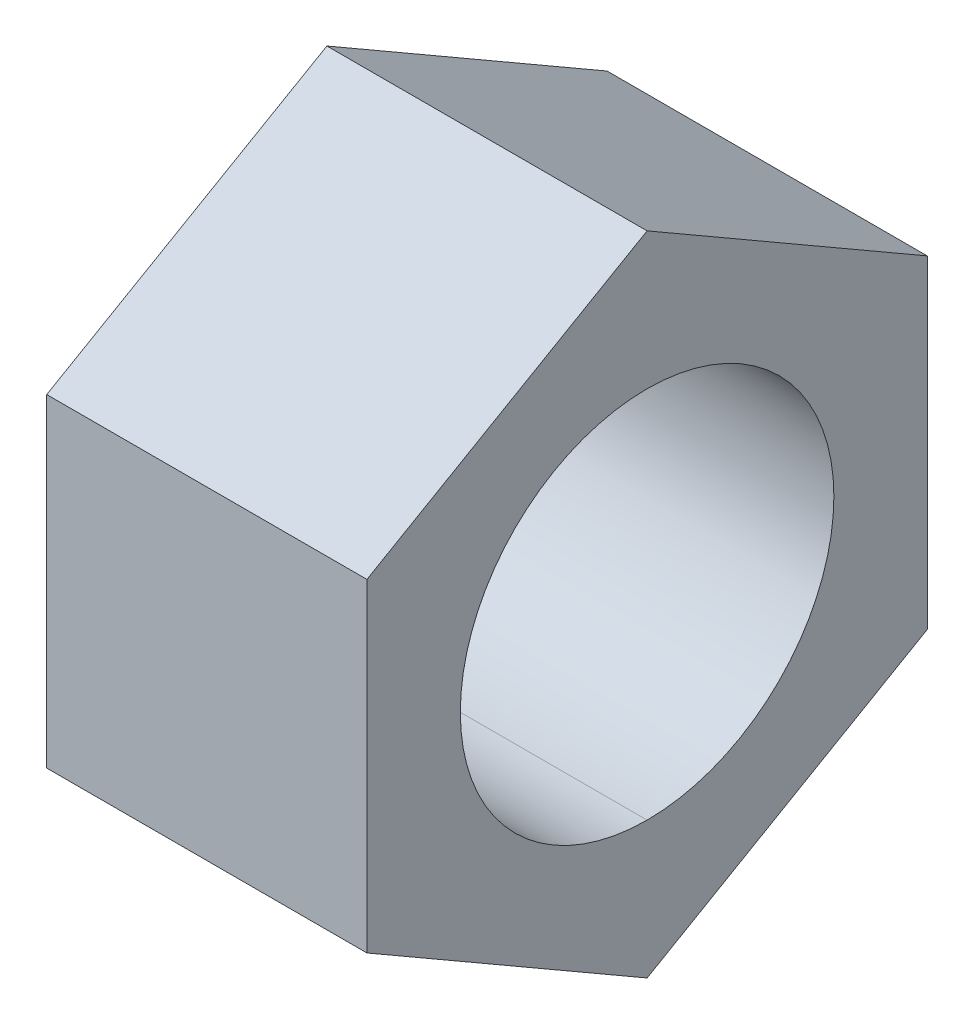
ISO-10303-21;
HEADER;
FILE_DESCRIPTION(('STEP AP214'),'2;1');
FILE_NAME('part.step','',(''),(''),'','','');
FILE_SCHEMA(('AUTOMOTIVE_DESIGN { 1 0 10303 214 1 1 1 1 }'));
ENDSEC;
DATA;
#1=APPLICATION_CONTEXT('core data for automotive mechanical design processes');
#2=APPLICATION_PROTOCOL_DEFINITION('international standard','automotive_design',2000,#1);
#3=PRODUCT_CONTEXT('',#1,'mechanical');
#4=PRODUCT('Part','Part','',(#3));
#5=PRODUCT_RELATED_PRODUCT_CATEGORY('part','',(#4));
#6=PRODUCT_DEFINITION_FORMATION('','',#4);
#7=PRODUCT_DEFINITION_CONTEXT('part definition',#1,'design');
#8=PRODUCT_DEFINITION('design','',#6,#7);
#9=PRODUCT_DEFINITION_SHAPE('','',#8);
#10=(LENGTH_UNIT() NAMED_UNIT(*) SI_UNIT(.MILLI.,.METRE.));
#11=(NAMED_UNIT(*) PLANE_ANGLE_UNIT() SI_UNIT($,.RADIAN.));
#12=(NAMED_UNIT(*) SI_UNIT($,.STERADIAN.) SOLID_ANGLE_UNIT());
#13=UNCERTAINTY_MEASURE_WITH_UNIT(LENGTH_MEASURE(1.E-05),#10,'distance_accuracy_value','');
#14=(GEOMETRIC_REPRESENTATION_CONTEXT(3) GLOBAL_UNCERTAINTY_ASSIGNED_CONTEXT((#13)) GLOBAL_UNIT_ASSIGNED_CONTEXT((#10,
#11,#12)) REPRESENTATION_CONTEXT('',''));
#15=CARTESIAN_POINT('',(0.,0.,0.));
#16=DIRECTION('',(0.,0.,1.));
#17=DIRECTION('',(1.,0.,0.));
#18=AXIS2_PLACEMENT_3D('',#15,#16,#17);
#19=CARTESIAN_POINT('',(-9.525,-19.2474145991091,0.));
#20=DIRECTION('',(0.,-0.866025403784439,0.499999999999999));
#21=DIRECTION('',(0.,-0.499999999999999,-0.866025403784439));
#22=AXIS2_PLACEMENT_3D('',#19,#20,#21);
#23=PLANE('',#22);
#24=DIRECTION('',(0.,0.499999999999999,0.866025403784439));
#25=VECTOR('',#24,1.);
#26=CARTESIAN_POINT('',(-9.525,-19.2474145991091,0.));
#27=LINE('',#26,#25);
#28=CARTESIAN_POINT('',(-9.525,-19.2474145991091,0.));
#29=VERTEX_POINT('',#28);
#30=CARTESIAN_POINT('',(-9.525,-9.62370729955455,16.66875));
#31=VERTEX_POINT('',#30);
#32=EDGE_CURVE('E109',#29,#31,#27,.T.);
#33=ORIENTED_EDGE('',*,*,#32,.F.);
#34=DIRECTION('',(1.,0.,0.));
#35=VECTOR('',#34,1.);
#36=CARTESIAN_POINT('',(-9.525,-19.2474145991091,0.));
#37=LINE('',#36,#35);
#38=CARTESIAN_POINT('',(9.525,-19.2474145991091,0.));
#39=VERTEX_POINT('',#38);
#40=EDGE_CURVE('E98',#39,#29,#37,.F.);
#41=ORIENTED_EDGE('',*,*,#40,.F.);
#42=DIRECTION('',(0.,0.499999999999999,0.866025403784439));
#43=VECTOR('',#42,1.);
#44=CARTESIAN_POINT('',(9.525,-19.2474145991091,0.));
#45=LINE('',#44,#43);
#46=CARTESIAN_POINT('',(9.525,-9.62370729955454,16.66875));
#47=VERTEX_POINT('',#46);
#48=EDGE_CURVE('E117',#39,#47,#45,.T.);
#49=ORIENTED_EDGE('',*,*,#48,.T.);
#50=DIRECTION('',(1.,0.,0.));
#51=VECTOR('',#50,1.);
#52=CARTESIAN_POINT('',(-9.525,-9.62370729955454,16.66875));
#53=LINE('',#52,#51);
#54=EDGE_CURVE('E135',#31,#47,#53,.T.);
#55=ORIENTED_EDGE('',*,*,#54,.F.);
#56=EDGE_LOOP('',(#33,#41,#49,#55));
#57=FACE_BOUND('',#56,.T.);
#58=ADVANCED_FACE('F16',(#57),#23,.T.);
#59=CARTESIAN_POINT('',(-9.525,-9.62370729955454,16.66875));
#60=DIRECTION('',(0.,0.,1.));
#61=DIRECTION('',(1.,0.,0.));
#62=AXIS2_PLACEMENT_3D('',#59,#60,#61);
#63=PLANE('',#62);
#64=DIRECTION('',(0.,-1.,0.));
#65=VECTOR('',#64,1.);
#66=CARTESIAN_POINT('',(-9.525,0.,16.66875));
#67=LINE('',#66,#65);
#68=CARTESIAN_POINT('',(-9.525,9.62370729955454,16.66875));
#69=VERTEX_POINT('',#68);
#70=EDGE_CURVE('E107',#31,#69,#67,.F.);
#71=ORIENTED_EDGE('',*,*,#70,.F.);
#72=ORIENTED_EDGE('',*,*,#54,.T.);
#73=DIRECTION('',(0.,-1.,0.));
#74=VECTOR('',#73,1.);
#75=CARTESIAN_POINT('',(9.525,-9.62370729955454,16.66875));
#76=LINE('',#75,#74);
#77=CARTESIAN_POINT('',(9.525,9.62370729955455,16.66875));
#78=VERTEX_POINT('',#77);
#79=EDGE_CURVE('E111',#47,#78,#76,.F.);
#80=ORIENTED_EDGE('',*,*,#79,.T.);
#81=DIRECTION('',(1.,0.,0.));
#82=VECTOR('',#81,1.);
#83=CARTESIAN_POINT('',(-9.525,9.62370729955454,16.66875));
#84=LINE('',#83,#82);
#85=EDGE_CURVE('E133',#69,#78,#84,.T.);
#86=ORIENTED_EDGE('',*,*,#85,.F.);
#87=EDGE_LOOP('',(#71,#72,#80,#86));
#88=FACE_BOUND('',#87,.T.);
#89=ADVANCED_FACE('F205',(#88),#63,.T.);
#90=CARTESIAN_POINT('',(-9.525,9.62370729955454,16.66875));
#91=DIRECTION('',(0.,0.866025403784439,0.499999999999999));
#92=DIRECTION('',(0.,-0.499999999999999,0.866025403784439));
#93=AXIS2_PLACEMENT_3D('',#90,#91,#92);
#94=PLANE('',#93);
#95=DIRECTION('',(0.,0.499999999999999,-0.866025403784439));
#96=VECTOR('',#95,1.);
#97=CARTESIAN_POINT('',(-9.525,9.62370729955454,16.66875));
#98=LINE('',#97,#96);
#99=CARTESIAN_POINT('',(-9.525,19.2474145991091,0.));
#100=VERTEX_POINT('',#99);
#101=EDGE_CURVE('E105',#69,#100,#98,.T.);
#102=ORIENTED_EDGE('',*,*,#101,.F.);
#103=ORIENTED_EDGE('',*,*,#85,.T.);
#104=DIRECTION('',(0.,0.499999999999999,-0.866025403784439));
#105=VECTOR('',#104,1.);
#106=CARTESIAN_POINT('',(9.525,9.62370729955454,16.66875));
#107=LINE('',#106,#105);
#108=CARTESIAN_POINT('',(9.525,19.2474145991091,0.));
#109=VERTEX_POINT('',#108);
#110=EDGE_CURVE('E97',#78,#109,#107,.T.);
#111=ORIENTED_EDGE('',*,*,#110,.T.);
#112=DIRECTION('',(1.,0.,0.));
#113=VECTOR('',#112,1.);
#114=CARTESIAN_POINT('',(-9.525,19.2474145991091,0.));
#115=LINE('',#114,#113);
#116=EDGE_CURVE('E131',#100,#109,#115,.T.);
#117=ORIENTED_EDGE('',*,*,#116,.F.);
#118=EDGE_LOOP('',(#102,#103,#111,#117));
#119=FACE_BOUND('',#118,.T.);
#120=ADVANCED_FACE('F197',(#119),#94,.T.);
#121=CARTESIAN_POINT('',(-9.525,19.2474145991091,0.));
#122=DIRECTION('',(0.,0.866025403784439,-0.499999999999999));
#123=DIRECTION('',(0.,0.499999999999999,0.866025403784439));
#124=AXIS2_PLACEMENT_3D('',#121,#122,#123);
#125=PLANE('',#124);
#126=DIRECTION('',(0.,-0.499999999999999,-0.866025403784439));
#127=VECTOR('',#126,1.);
#128=CARTESIAN_POINT('',(-9.525,19.2474145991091,0.));
#129=LINE('',#128,#127);
#130=CARTESIAN_POINT('',(-9.525,9.62370729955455,-16.66875));
#131=VERTEX_POINT('',#130);
#132=EDGE_CURVE('E85',#100,#131,#129,.T.);
#133=ORIENTED_EDGE('',*,*,#132,.F.);
#134=ORIENTED_EDGE('',*,*,#116,.T.);
#135=DIRECTION('',(0.,-0.499999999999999,-0.866025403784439));
#136=VECTOR('',#135,1.);
#137=CARTESIAN_POINT('',(9.52499999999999,19.2474145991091,0.));
#138=LINE('',#137,#136);
#139=CARTESIAN_POINT('',(9.525,9.62370729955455,-16.66875));
#140=VERTEX_POINT('',#139);
#141=EDGE_CURVE('E123',#109,#140,#138,.T.);
#142=ORIENTED_EDGE('',*,*,#141,.T.);
#143=DIRECTION('',(-1.,0.,0.));
#144=VECTOR('',#143,1.);
#145=CARTESIAN_POINT('',(-9.525,9.62370729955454,-16.66875));
#146=LINE('',#145,#144);
#147=EDGE_CURVE('E129',#131,#140,#146,.F.);
#148=ORIENTED_EDGE('',*,*,#147,.F.);
#149=EDGE_LOOP('',(#133,#134,#142,#148));
#150=FACE_BOUND('',#149,.T.);
#151=ADVANCED_FACE('F190',(#150),#125,.T.);
#152=CARTESIAN_POINT('',(-9.525,9.62370729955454,-16.66875));
#153=DIRECTION('',(0.,0.,-1.));
#154=DIRECTION('',(-1.,0.,0.));
#155=AXIS2_PLACEMENT_3D('',#152,#153,#154);
#156=PLANE('',#155);
#157=DIRECTION('',(0.,-1.,0.));
#158=VECTOR('',#157,1.);
#159=CARTESIAN_POINT('',(-9.525,0.,-16.66875));
#160=LINE('',#159,#158);
#161=CARTESIAN_POINT('',(-9.525,-9.62370729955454,-16.66875));
#162=VERTEX_POINT('',#161);
#163=EDGE_CURVE('E77',#131,#162,#160,.T.);
#164=ORIENTED_EDGE('',*,*,#163,.F.);
#165=ORIENTED_EDGE('',*,*,#147,.T.);
#166=DIRECTION('',(0.,-1.,0.));
#167=VECTOR('',#166,1.);
#168=CARTESIAN_POINT('',(9.525,-9.62370729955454,-16.66875));
#169=LINE('',#168,#167);
#170=CARTESIAN_POINT('',(9.525,-9.62370729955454,-16.66875));
#171=VERTEX_POINT('',#170);
#172=EDGE_CURVE('E93',#140,#171,#169,.T.);
#173=ORIENTED_EDGE('',*,*,#172,.T.);
#174=DIRECTION('',(1.,0.,0.));
#175=VECTOR('',#174,1.);
#176=CARTESIAN_POINT('',(-9.525,-9.62370729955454,-16.66875));
#177=LINE('',#176,#175);
#178=EDGE_CURVE('E90',#162,#171,#177,.T.);
#179=ORIENTED_EDGE('',*,*,#178,.F.);
#180=EDGE_LOOP('',(#164,#165,#173,#179));
#181=FACE_BOUND('',#180,.T.);
#182=ADVANCED_FACE('F91',(#181),#156,.T.);
#183=CARTESIAN_POINT('',(-9.525,-9.62370729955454,-16.66875));
#184=DIRECTION('',(0.,-0.866025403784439,-0.499999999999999));
#185=DIRECTION('',(0.,0.499999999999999,-0.866025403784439));
#186=AXIS2_PLACEMENT_3D('',#183,#184,#185);
#187=PLANE('',#186);
#188=DIRECTION('',(0.,-0.499999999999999,0.866025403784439));
#189=VECTOR('',#188,1.);
#190=CARTESIAN_POINT('',(-9.525,-9.62370729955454,-16.66875));
#191=LINE('',#190,#189);
#192=EDGE_CURVE('E82',#162,#29,#191,.T.);
#193=ORIENTED_EDGE('',*,*,#192,.F.);
#194=ORIENTED_EDGE('',*,*,#178,.T.);
#195=DIRECTION('',(0.,-0.499999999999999,0.866025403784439));
#196=VECTOR('',#195,1.);
#197=CARTESIAN_POINT('',(9.525,-9.62370729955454,-16.66875));
#198=LINE('',#197,#196);
#199=EDGE_CURVE('E120',#171,#39,#198,.T.);
#200=ORIENTED_EDGE('',*,*,#199,.T.);
#201=ORIENTED_EDGE('',*,*,#40,.T.);
#202=EDGE_LOOP('',(#193,#194,#200,#201));
#203=FACE_BOUND('',#202,.T.);
#204=ADVANCED_FACE('F100',(#203),#187,.T.);
#205=CARTESIAN_POINT('',(9.525,-9.62370729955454,16.66875));
#206=DIRECTION('',(-1.,0.,0.));
#207=DIRECTION('',(0.,-1.,0.));
#208=AXIS2_PLACEMENT_3D('',#205,#206,#207);
#209=PLANE('',#208);
#210=ORIENTED_EDGE('',*,*,#48,.F.);
#211=ORIENTED_EDGE('',*,*,#199,.F.);
#212=ORIENTED_EDGE('',*,*,#172,.F.);
#213=ORIENTED_EDGE('',*,*,#141,.F.);
#214=ORIENTED_EDGE('',*,*,#110,.F.);
#215=ORIENTED_EDGE('',*,*,#79,.F.);
#216=EDGE_LOOP('',(#210,#211,#212,#213,#214,#215));
#217=FACE_BOUND('',#216,.T.);
#218=CARTESIAN_POINT('',(9.525,0.,0.));
#219=DIRECTION('',(1.,0.,0.));
#220=DIRECTION('',(0.,1.,0.));
#221=AXIS2_PLACEMENT_3D('',#218,#219,#220);
#222=CIRCLE('',#221,11.1125);
#223=CARTESIAN_POINT('',(9.525,-11.1125,0.));
#224=VERTEX_POINT('',#223);
#225=CARTESIAN_POINT('',(9.525,11.1125,0.));
#226=VERTEX_POINT('',#225);
#227=EDGE_CURVE('E102',#224,#226,#222,.F.);
#228=ORIENTED_EDGE('',*,*,#227,.T.);
#229=CARTESIAN_POINT('',(9.525,0.,0.));
#230=DIRECTION('',(1.,0.,0.));
#231=DIRECTION('',(0.,1.,0.));
#232=AXIS2_PLACEMENT_3D('',#229,#230,#231);
#233=CIRCLE('',#232,11.1125);
#234=EDGE_CURVE('E113',#226,#224,#233,.F.);
#235=ORIENTED_EDGE('',*,*,#234,.T.);
#236=EDGE_LOOP('',(#228,#235));
#237=FACE_BOUND('',#236,.T.);
#238=ADVANCED_FACE('F142',(#217,#237),#209,.F.);
#239=CARTESIAN_POINT('',(-9.525,0.,0.));
#240=DIRECTION('',(-1.,0.,0.));
#241=DIRECTION('',(0.,-1.,0.));
#242=AXIS2_PLACEMENT_3D('',#239,#240,#241);
#243=PLANE('',#242);
#244=ORIENTED_EDGE('',*,*,#163,.T.);
#245=ORIENTED_EDGE('',*,*,#192,.T.);
#246=ORIENTED_EDGE('',*,*,#32,.T.);
#247=ORIENTED_EDGE('',*,*,#70,.T.);
#248=ORIENTED_EDGE('',*,*,#101,.T.);
#249=ORIENTED_EDGE('',*,*,#132,.T.);
#250=EDGE_LOOP('',(#244,#245,#246,#247,#248,#249));
#251=FACE_BOUND('',#250,.T.);
#252=CARTESIAN_POINT('',(-9.525,0.,0.));
#253=DIRECTION('',(1.,0.,0.));
#254=DIRECTION('',(0.,1.,0.));
#255=AXIS2_PLACEMENT_3D('',#252,#253,#254);
#256=CIRCLE('',#255,11.1125);
#257=CARTESIAN_POINT('',(-9.525,11.1125,0.));
#258=VERTEX_POINT('',#257);
#259=CARTESIAN_POINT('',(-9.525,-11.1125,0.));
#260=VERTEX_POINT('',#259);
#261=EDGE_CURVE('E19',#258,#260,#256,.T.);
#262=ORIENTED_EDGE('',*,*,#261,.T.);
#263=CARTESIAN_POINT('',(-9.525,0.,0.));
#264=DIRECTION('',(1.,0.,0.));
#265=DIRECTION('',(0.,1.,0.));
#266=AXIS2_PLACEMENT_3D('',#263,#264,#265);
#267=CIRCLE('',#266,11.1125);
#268=EDGE_CURVE('E25',#260,#258,#267,.T.);
#269=ORIENTED_EDGE('',*,*,#268,.T.);
#270=EDGE_LOOP('',(#262,#269));
#271=FACE_BOUND('',#270,.T.);
#272=ADVANCED_FACE('F79',(#251,#271),#243,.T.);
#273=CARTESIAN_POINT('',(0.,0.,0.));
#274=DIRECTION('',(1.,0.,0.));
#275=DIRECTION('',(0.,1.,0.));
#276=AXIS2_PLACEMENT_3D('',#273,#274,#275);
#277=CYLINDRICAL_SURFACE('',#276,11.1125);
#278=ORIENTED_EDGE('',*,*,#227,.F.);
#279=DIRECTION('',(1.,0.,0.));
#280=VECTOR('',#279,1.);
#281=CARTESIAN_POINT('',(0.,-11.1125,0.));
#282=LINE('',#281,#280);
#283=EDGE_CURVE('E112',#224,#260,#282,.F.);
#284=ORIENTED_EDGE('',*,*,#283,.T.);
#285=ORIENTED_EDGE('',*,*,#261,.F.);
#286=DIRECTION('',(1.,0.,0.));
#287=VECTOR('',#286,1.);
#288=CARTESIAN_POINT('',(0.,11.1125,0.));
#289=LINE('',#288,#287);
#290=EDGE_CURVE('E11',#258,#226,#289,.T.);
#291=ORIENTED_EDGE('',*,*,#290,.T.);
#292=EDGE_LOOP('',(#278,#284,#285,#291));
#293=FACE_BOUND('',#292,.T.);
#294=ADVANCED_FACE('F144',(#293),#277,.F.);
#295=CARTESIAN_POINT('',(0.,0.,0.));
#296=DIRECTION('',(1.,0.,0.));
#297=DIRECTION('',(0.,1.,0.));
#298=AXIS2_PLACEMENT_3D('',#295,#296,#297);
#299=CYLINDRICAL_SURFACE('',#298,11.1125);
#300=ORIENTED_EDGE('',*,*,#268,.F.);
#301=ORIENTED_EDGE('',*,*,#283,.F.);
#302=ORIENTED_EDGE('',*,*,#234,.F.);
#303=ORIENTED_EDGE('',*,*,#290,.F.);
#304=EDGE_LOOP('',(#300,#301,#302,#303));
#305=FACE_BOUND('',#304,.T.);
#306=ADVANCED_FACE('F147',(#305),#299,.F.);
#307=CLOSED_SHELL('',(#58,#89,#120,#151,#182,#204,#238,#272,#294,#306));
#308=MANIFOLD_SOLID_BREP('B1',#307);
#309=ADVANCED_BREP_SHAPE_REPRESENTATION('',(#18,#308),#14);
#310=SHAPE_DEFINITION_REPRESENTATION(#9,#309);
ENDSEC;
END-ISO-10303-21;
